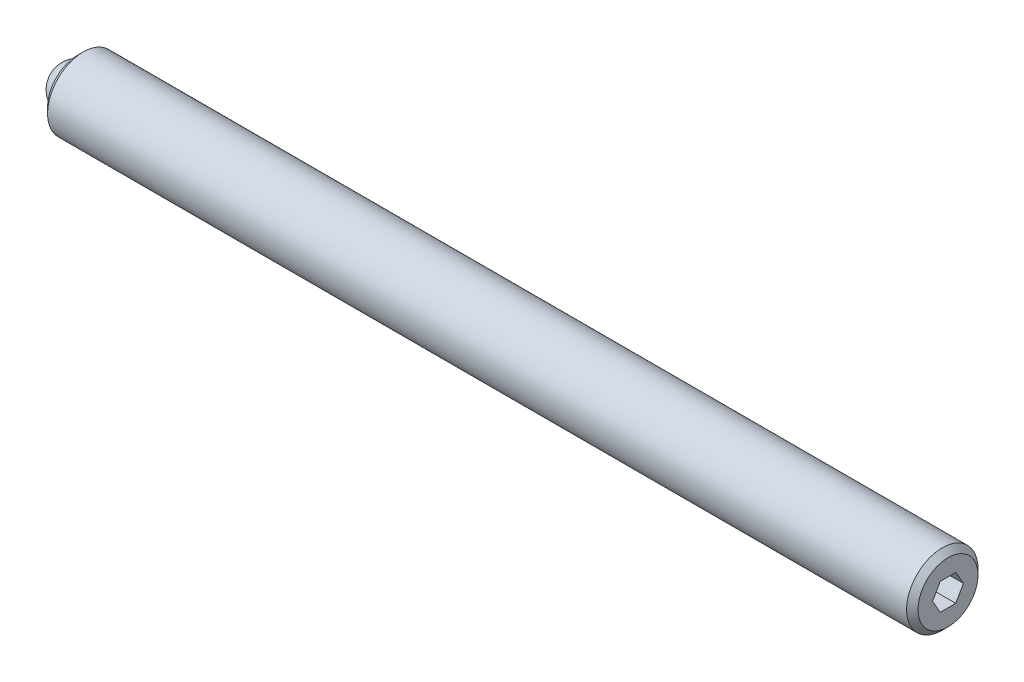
ISO-10303-21;
HEADER;
FILE_DESCRIPTION(('STEP AP214'),'2;1');
FILE_NAME('part.step','',(''),(''),'','','');
FILE_SCHEMA(('AUTOMOTIVE_DESIGN { 1 0 10303 214 1 1 1 1 }'));
ENDSEC;
DATA;
#1=APPLICATION_CONTEXT('core data for automotive mechanical design processes');
#2=APPLICATION_PROTOCOL_DEFINITION('international standard','automotive_design',2000,#1);
#3=PRODUCT_CONTEXT('',#1,'mechanical');
#4=PRODUCT('Part','Part','',(#3));
#5=PRODUCT_RELATED_PRODUCT_CATEGORY('part','',(#4));
#6=PRODUCT_DEFINITION_FORMATION('','',#4);
#7=PRODUCT_DEFINITION_CONTEXT('part definition',#1,'design');
#8=PRODUCT_DEFINITION('design','',#6,#7);
#9=PRODUCT_DEFINITION_SHAPE('','',#8);
#10=(LENGTH_UNIT() NAMED_UNIT(*) SI_UNIT(.MILLI.,.METRE.));
#11=(NAMED_UNIT(*) PLANE_ANGLE_UNIT() SI_UNIT($,.RADIAN.));
#12=(NAMED_UNIT(*) SI_UNIT($,.STERADIAN.) SOLID_ANGLE_UNIT());
#13=UNCERTAINTY_MEASURE_WITH_UNIT(LENGTH_MEASURE(1.E-05),#10,'distance_accuracy_value','');
#14=(GEOMETRIC_REPRESENTATION_CONTEXT(3) GLOBAL_UNCERTAINTY_ASSIGNED_CONTEXT((#13)) GLOBAL_UNIT_ASSIGNED_CONTEXT((#10,
#11,#12)) REPRESENTATION_CONTEXT('',''));
#15=CARTESIAN_POINT('',(0.,0.,0.));
#16=DIRECTION('',(0.,0.,1.));
#17=DIRECTION('',(1.,0.,0.));
#18=AXIS2_PLACEMENT_3D('',#15,#16,#17);
#19=CARTESIAN_POINT('',(0.,0.,0.));
#20=DIRECTION('',(0.,-1.,0.));
#21=DIRECTION('',(0.,0.,1.));
#22=AXIS2_PLACEMENT_3D('',#19,#20,#21);
#23=SPHERICAL_SURFACE('',#22,1.984375);
#24=CARTESIAN_POINT('',(0.,-1.984375,0.));
#25=VERTEX_POINT('',#24);
#26=VERTEX_LOOP('',#25);
#27=FACE_BOUND('',#26,.T.);
#28=ADVANCED_FACE('F43',(#27),#23,.T.);
#29=CLOSED_SHELL('',(#28));
#30=MANIFOLD_SOLID_BREP('B2',#29);
#31=CARTESIAN_POINT('',(77.390625,0.,0.));
#32=DIRECTION('',(-1.,0.,0.));
#33=DIRECTION('',(0.,0.,1.));
#34=AXIS2_PLACEMENT_3D('',#31,#32,#33);
#35=CYLINDRICAL_SURFACE('',#34,3.175);
#36=CARTESIAN_POINT('',(76.882625,0.,0.));
#37=DIRECTION('',(1.,0.,0.));
#38=DIRECTION('',(0.,0.,-1.));
#39=AXIS2_PLACEMENT_3D('',#36,#37,#38);
#40=CIRCLE('',#39,3.175);
#41=CARTESIAN_POINT('',(76.882625,0.,-3.175));
#42=VERTEX_POINT('',#41);
#43=EDGE_CURVE('E41',#42,#42,#40,.F.);
#44=ORIENTED_EDGE('',*,*,#43,.T.);
#45=EDGE_LOOP('',(#44));
#46=FACE_BOUND('',#45,.T.);
#47=CARTESIAN_POINT('',(0.507999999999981,0.,0.));
#48=DIRECTION('',(1.,0.,0.));
#49=DIRECTION('',(0.,0.,-1.));
#50=AXIS2_PLACEMENT_3D('',#47,#48,#49);
#51=CIRCLE('',#50,3.175);
#52=CARTESIAN_POINT('',(0.507999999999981,0.,-3.175));
#53=VERTEX_POINT('',#52);
#54=EDGE_CURVE('E159',#53,#53,#51,.T.);
#55=ORIENTED_EDGE('',*,*,#54,.T.);
#56=EDGE_LOOP('',(#55));
#57=FACE_BOUND('',#56,.T.);
#58=ADVANCED_FACE('F56',(#46,#57),#35,.T.);
#59=CARTESIAN_POINT('',(77.390625,0.,0.));
#60=DIRECTION('',(1.,0.,0.));
#61=DIRECTION('',(0.,0.,-1.));
#62=AXIS2_PLACEMENT_3D('',#59,#60,#61);
#63=PLANE('',#62);
#64=DIRECTION('',(0.,0.866025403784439,-0.5));
#65=VECTOR('',#64,1.);
#66=CARTESIAN_POINT('',(77.390625,-1.190625,-0.687407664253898));
#67=LINE('',#66,#65);
#68=CARTESIAN_POINT('',(77.390625,-1.190625,-0.687407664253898));
#69=VERTEX_POINT('',#68);
#70=CARTESIAN_POINT('',(77.390625,0.,-1.3748153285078));
#71=VERTEX_POINT('',#70);
#72=EDGE_CURVE('E71',#69,#71,#67,.T.);
#73=ORIENTED_EDGE('',*,*,#72,.F.);
#74=DIRECTION('',(0.,0.,-1.));
#75=VECTOR('',#74,1.);
#76=CARTESIAN_POINT('',(77.390625,-1.190625,0.687407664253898));
#77=LINE('',#76,#75);
#78=CARTESIAN_POINT('',(77.390625,-1.190625,0.687407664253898));
#79=VERTEX_POINT('',#78);
#80=EDGE_CURVE('E155',#79,#69,#77,.T.);
#81=ORIENTED_EDGE('',*,*,#80,.F.);
#82=DIRECTION('',(0.,-0.866025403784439,-0.5));
#83=VECTOR('',#82,1.);
#84=CARTESIAN_POINT('',(77.390625,0.,1.3748153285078));
#85=LINE('',#84,#83);
#86=CARTESIAN_POINT('',(77.390625,0.,1.3748153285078));
#87=VERTEX_POINT('',#86);
#88=EDGE_CURVE('E153',#87,#79,#85,.T.);
#89=ORIENTED_EDGE('',*,*,#88,.F.);
#90=DIRECTION('',(0.,-0.866025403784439,0.5));
#91=VECTOR('',#90,1.);
#92=CARTESIAN_POINT('',(77.390625,1.190625,0.687407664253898));
#93=LINE('',#92,#91);
#94=CARTESIAN_POINT('',(77.390625,1.190625,0.687407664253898));
#95=VERTEX_POINT('',#94);
#96=EDGE_CURVE('E119',#95,#87,#93,.T.);
#97=ORIENTED_EDGE('',*,*,#96,.F.);
#98=DIRECTION('',(0.,0.,1.));
#99=VECTOR('',#98,1.);
#100=CARTESIAN_POINT('',(77.390625,1.190625,-0.687407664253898));
#101=LINE('',#100,#99);
#102=CARTESIAN_POINT('',(77.390625,1.190625,-0.687407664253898));
#103=VERTEX_POINT('',#102);
#104=EDGE_CURVE('E149',#103,#95,#101,.T.);
#105=ORIENTED_EDGE('',*,*,#104,.F.);
#106=DIRECTION('',(0.,0.866025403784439,0.5));
#107=VECTOR('',#106,1.);
#108=CARTESIAN_POINT('',(77.390625,0.,-1.3748153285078));
#109=LINE('',#108,#107);
#110=EDGE_CURVE('E145',#71,#103,#109,.T.);
#111=ORIENTED_EDGE('',*,*,#110,.F.);
#112=EDGE_LOOP('',(#73,#81,#89,#97,#105,#111));
#113=FACE_BOUND('',#112,.T.);
#114=CARTESIAN_POINT('',(77.390625,0.,0.));
#115=DIRECTION('',(1.,0.,0.));
#116=DIRECTION('',(0.,0.,-1.));
#117=AXIS2_PLACEMENT_3D('',#114,#115,#116);
#118=CIRCLE('',#117,2.66700000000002);
#119=CARTESIAN_POINT('',(77.390625,0.,-2.66700000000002));
#120=VERTEX_POINT('',#119);
#121=EDGE_CURVE('E64',#120,#120,#118,.T.);
#122=ORIENTED_EDGE('',*,*,#121,.T.);
#123=EDGE_LOOP('',(#122));
#124=FACE_BOUND('',#123,.T.);
#125=ADVANCED_FACE('F172',(#113,#124),#63,.T.);
#126=CARTESIAN_POINT('',(0.,0.,0.));
#127=DIRECTION('',(1.,0.,0.));
#128=DIRECTION('',(0.,0.,-1.));
#129=AXIS2_PLACEMENT_3D('',#126,#127,#128);
#130=PLANE('',#129);
#131=CARTESIAN_POINT('',(0.,0.,0.));
#132=DIRECTION('',(-1.,0.,0.));
#133=DIRECTION('',(0.,0.,1.));
#134=AXIS2_PLACEMENT_3D('',#131,#132,#133);
#135=CIRCLE('',#134,1.9812);
#136=CARTESIAN_POINT('',(0.,0.,1.9812));
#137=VERTEX_POINT('',#136);
#138=EDGE_CURVE('E227',#137,#137,#135,.T.);
#139=ORIENTED_EDGE('',*,*,#138,.F.);
#140=EDGE_LOOP('',(#139));
#141=FACE_BOUND('',#140,.T.);
#142=CARTESIAN_POINT('',(0.,0.,0.));
#143=DIRECTION('',(1.,0.,0.));
#144=DIRECTION('',(0.,0.,-1.));
#145=AXIS2_PLACEMENT_3D('',#142,#143,#144);
#146=CIRCLE('',#145,2.66700000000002);
#147=CARTESIAN_POINT('',(0.,0.,-2.66700000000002));
#148=VERTEX_POINT('',#147);
#149=EDGE_CURVE('E167',#148,#148,#146,.F.);
#150=ORIENTED_EDGE('',*,*,#149,.T.);
#151=EDGE_LOOP('',(#150));
#152=FACE_BOUND('',#151,.T.);
#153=ADVANCED_FACE('F184',(#141,#152),#130,.F.);
#154=CARTESIAN_POINT('',(0.507999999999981,0.,0.));
#155=DIRECTION('',(1.,0.,0.));
#156=DIRECTION('',(0.,0.,-1.));
#157=AXIS2_PLACEMENT_3D('',#154,#155,#156);
#158=CONICAL_SURFACE('',#157,3.175,0.78539816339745);
#159=ORIENTED_EDGE('',*,*,#149,.F.);
#160=EDGE_LOOP('',(#159));
#161=FACE_BOUND('',#160,.T.);
#162=ORIENTED_EDGE('',*,*,#54,.F.);
#163=EDGE_LOOP('',(#162));
#164=FACE_BOUND('',#163,.T.);
#165=ADVANCED_FACE('F176',(#161,#164),#158,.T.);
#166=CARTESIAN_POINT('',(77.390625,0.,0.));
#167=DIRECTION('',(-1.,0.,0.));
#168=DIRECTION('',(0.,0.,1.));
#169=AXIS2_PLACEMENT_3D('',#166,#167,#168);
#170=CONICAL_SURFACE('',#169,2.66700000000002,0.785398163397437);
#171=ORIENTED_EDGE('',*,*,#43,.F.);
#172=EDGE_LOOP('',(#171));
#173=FACE_BOUND('',#172,.T.);
#174=ORIENTED_EDGE('',*,*,#121,.F.);
#175=EDGE_LOOP('',(#174));
#176=FACE_BOUND('',#175,.T.);
#177=ADVANCED_FACE('F58',(#173,#176),#170,.T.);
#178=CARTESIAN_POINT('',(75.104625,-1.190625,-0.687407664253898));
#179=DIRECTION('',(0.,-0.5,-0.866025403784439));
#180=DIRECTION('',(0.,0.866025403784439,-0.5));
#181=AXIS2_PLACEMENT_3D('',#178,#179,#180);
#182=PLANE('',#181);
#183=ORIENTED_EDGE('',*,*,#72,.T.);
#184=DIRECTION('',(1.,0.,0.));
#185=VECTOR('',#184,1.);
#186=CARTESIAN_POINT('',(75.104625,0.,-1.3748153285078));
#187=LINE('',#186,#185);
#188=CARTESIAN_POINT('',(75.104625,0.,-1.3748153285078));
#189=VERTEX_POINT('',#188);
#190=EDGE_CURVE('E101',#189,#71,#187,.T.);
#191=ORIENTED_EDGE('',*,*,#190,.F.);
#192=DIRECTION('',(0.,0.866025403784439,-0.5));
#193=VECTOR('',#192,1.);
#194=CARTESIAN_POINT('',(75.104625,-1.190625,-0.687407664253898));
#195=LINE('',#194,#193);
#196=CARTESIAN_POINT('',(75.104625,-1.190625,-0.687407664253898));
#197=VERTEX_POINT('',#196);
#198=EDGE_CURVE('E157',#197,#189,#195,.T.);
#199=ORIENTED_EDGE('',*,*,#198,.F.);
#200=DIRECTION('',(1.,0.,0.));
#201=VECTOR('',#200,1.);
#202=CARTESIAN_POINT('',(75.104625,-1.190625,-0.687407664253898));
#203=LINE('',#202,#201);
#204=EDGE_CURVE('E79',#197,#69,#203,.T.);
#205=ORIENTED_EDGE('',*,*,#204,.T.);
#206=EDGE_LOOP('',(#183,#191,#199,#205));
#207=FACE_BOUND('',#206,.T.);
#208=ADVANCED_FACE('F175',(#207),#182,.F.);
#209=CARTESIAN_POINT('',(75.104625,-1.190625,0.687407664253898));
#210=DIRECTION('',(0.,-1.,0.));
#211=DIRECTION('',(0.,0.,-1.));
#212=AXIS2_PLACEMENT_3D('',#209,#210,#211);
#213=PLANE('',#212);
#214=ORIENTED_EDGE('',*,*,#80,.T.);
#215=ORIENTED_EDGE('',*,*,#204,.F.);
#216=DIRECTION('',(0.,0.,-1.));
#217=VECTOR('',#216,1.);
#218=CARTESIAN_POINT('',(75.104625,-1.190625,0.687407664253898));
#219=LINE('',#218,#217);
#220=CARTESIAN_POINT('',(75.104625,-1.190625,0.687407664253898));
#221=VERTEX_POINT('',#220);
#222=EDGE_CURVE('E131',#221,#197,#219,.T.);
#223=ORIENTED_EDGE('',*,*,#222,.F.);
#224=DIRECTION('',(1.,0.,0.));
#225=VECTOR('',#224,1.);
#226=CARTESIAN_POINT('',(75.104625,-1.190625,0.687407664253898));
#227=LINE('',#226,#225);
#228=EDGE_CURVE('E123',#221,#79,#227,.T.);
#229=ORIENTED_EDGE('',*,*,#228,.T.);
#230=EDGE_LOOP('',(#214,#215,#223,#229));
#231=FACE_BOUND('',#230,.T.);
#232=ADVANCED_FACE('F182',(#231),#213,.F.);
#233=CARTESIAN_POINT('',(75.104625,0.,1.3748153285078));
#234=DIRECTION('',(0.,-0.5,0.866025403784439));
#235=DIRECTION('',(0.,-0.866025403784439,-0.5));
#236=AXIS2_PLACEMENT_3D('',#233,#234,#235);
#237=PLANE('',#236);
#238=ORIENTED_EDGE('',*,*,#88,.T.);
#239=ORIENTED_EDGE('',*,*,#228,.F.);
#240=DIRECTION('',(0.,-0.866025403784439,-0.5));
#241=VECTOR('',#240,1.);
#242=CARTESIAN_POINT('',(75.104625,0.,1.3748153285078));
#243=LINE('',#242,#241);
#244=CARTESIAN_POINT('',(75.104625,0.,1.3748153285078));
#245=VERTEX_POINT('',#244);
#246=EDGE_CURVE('E127',#245,#221,#243,.T.);
#247=ORIENTED_EDGE('',*,*,#246,.F.);
#248=DIRECTION('',(1.,0.,0.));
#249=VECTOR('',#248,1.);
#250=CARTESIAN_POINT('',(75.104625,0.,1.3748153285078));
#251=LINE('',#250,#249);
#252=EDGE_CURVE('E112',#245,#87,#251,.T.);
#253=ORIENTED_EDGE('',*,*,#252,.T.);
#254=EDGE_LOOP('',(#238,#239,#247,#253));
#255=FACE_BOUND('',#254,.T.);
#256=ADVANCED_FACE('F128',(#255),#237,.F.);
#257=CARTESIAN_POINT('',(75.104625,1.190625,0.687407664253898));
#258=DIRECTION('',(0.,0.5,0.866025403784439));
#259=DIRECTION('',(0.,-0.866025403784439,0.5));
#260=AXIS2_PLACEMENT_3D('',#257,#258,#259);
#261=PLANE('',#260);
#262=ORIENTED_EDGE('',*,*,#96,.T.);
#263=ORIENTED_EDGE('',*,*,#252,.F.);
#264=DIRECTION('',(0.,-0.866025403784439,0.5));
#265=VECTOR('',#264,1.);
#266=CARTESIAN_POINT('',(75.104625,1.190625,0.687407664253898));
#267=LINE('',#266,#265);
#268=CARTESIAN_POINT('',(75.104625,1.190625,0.687407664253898));
#269=VERTEX_POINT('',#268);
#270=EDGE_CURVE('E116',#269,#245,#267,.T.);
#271=ORIENTED_EDGE('',*,*,#270,.F.);
#272=DIRECTION('',(1.,0.,0.));
#273=VECTOR('',#272,1.);
#274=CARTESIAN_POINT('',(75.104625,1.190625,0.687407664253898));
#275=LINE('',#274,#273);
#276=EDGE_CURVE('E124',#269,#95,#275,.T.);
#277=ORIENTED_EDGE('',*,*,#276,.T.);
#278=EDGE_LOOP('',(#262,#263,#271,#277));
#279=FACE_BOUND('',#278,.T.);
#280=ADVANCED_FACE('F114',(#279),#261,.F.);
#281=CARTESIAN_POINT('',(75.104625,1.190625,-0.687407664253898));
#282=DIRECTION('',(0.,1.,0.));
#283=DIRECTION('',(0.,0.,1.));
#284=AXIS2_PLACEMENT_3D('',#281,#282,#283);
#285=PLANE('',#284);
#286=ORIENTED_EDGE('',*,*,#104,.T.);
#287=ORIENTED_EDGE('',*,*,#276,.F.);
#288=DIRECTION('',(0.,0.,1.));
#289=VECTOR('',#288,1.);
#290=CARTESIAN_POINT('',(75.104625,1.190625,-0.687407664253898));
#291=LINE('',#290,#289);
#292=CARTESIAN_POINT('',(75.104625,1.190625,-0.687407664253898));
#293=VERTEX_POINT('',#292);
#294=EDGE_CURVE('E137',#293,#269,#291,.T.);
#295=ORIENTED_EDGE('',*,*,#294,.F.);
#296=DIRECTION('',(1.,0.,0.));
#297=VECTOR('',#296,1.);
#298=CARTESIAN_POINT('',(75.104625,1.190625,-0.687407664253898));
#299=LINE('',#298,#297);
#300=EDGE_CURVE('E162',#293,#103,#299,.T.);
#301=ORIENTED_EDGE('',*,*,#300,.T.);
#302=EDGE_LOOP('',(#286,#287,#295,#301));
#303=FACE_BOUND('',#302,.T.);
#304=ADVANCED_FACE('F203',(#303),#285,.F.);
#305=CARTESIAN_POINT('',(75.104625,0.,-1.3748153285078));
#306=DIRECTION('',(0.,0.5,-0.866025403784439));
#307=DIRECTION('',(0.,0.866025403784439,0.5));
#308=AXIS2_PLACEMENT_3D('',#305,#306,#307);
#309=PLANE('',#308);
#310=ORIENTED_EDGE('',*,*,#110,.T.);
#311=ORIENTED_EDGE('',*,*,#300,.F.);
#312=DIRECTION('',(0.,0.866025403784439,0.5));
#313=VECTOR('',#312,1.);
#314=CARTESIAN_POINT('',(75.104625,0.,-1.3748153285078));
#315=LINE('',#314,#313);
#316=EDGE_CURVE('E139',#189,#293,#315,.T.);
#317=ORIENTED_EDGE('',*,*,#316,.F.);
#318=ORIENTED_EDGE('',*,*,#190,.T.);
#319=EDGE_LOOP('',(#310,#311,#317,#318));
#320=FACE_BOUND('',#319,.T.);
#321=ADVANCED_FACE('F200',(#320),#309,.F.);
#322=CARTESIAN_POINT('',(75.104625,0.,0.));
#323=DIRECTION('',(1.,0.,0.));
#324=DIRECTION('',(0.,0.,-1.));
#325=AXIS2_PLACEMENT_3D('',#322,#323,#324);
#326=PLANE('',#325);
#327=ORIENTED_EDGE('',*,*,#198,.T.);
#328=ORIENTED_EDGE('',*,*,#316,.T.);
#329=ORIENTED_EDGE('',*,*,#294,.T.);
#330=ORIENTED_EDGE('',*,*,#270,.T.);
#331=ORIENTED_EDGE('',*,*,#246,.T.);
#332=ORIENTED_EDGE('',*,*,#222,.T.);
#333=EDGE_LOOP('',(#327,#328,#329,#330,#331,#332));
#334=FACE_BOUND('',#333,.T.);
#335=ADVANCED_FACE('F134',(#334),#326,.T.);
#336=CARTESIAN_POINT('',(1.984375,0.,0.));
#337=DIRECTION('',(-1.,0.,0.));
#338=DIRECTION('',(0.,0.,1.));
#339=AXIS2_PLACEMENT_3D('',#336,#337,#338);
#340=CYLINDRICAL_SURFACE('',#339,1.9812);
#341=CARTESIAN_POINT('',(1.984375,0.,0.));
#342=DIRECTION('',(-1.,0.,0.));
#343=DIRECTION('',(0.,0.,1.));
#344=AXIS2_PLACEMENT_3D('',#341,#342,#343);
#345=CIRCLE('',#344,1.9812);
#346=CARTESIAN_POINT('',(1.984375,0.,1.9812));
#347=VERTEX_POINT('',#346);
#348=EDGE_CURVE('E146',#347,#347,#345,.T.);
#349=ORIENTED_EDGE('',*,*,#348,.F.);
#350=EDGE_LOOP('',(#349));
#351=FACE_BOUND('',#350,.T.);
#352=ORIENTED_EDGE('',*,*,#138,.T.);
#353=EDGE_LOOP('',(#352));
#354=FACE_BOUND('',#353,.T.);
#355=ADVANCED_FACE('F216',(#351,#354),#340,.F.);
#356=CARTESIAN_POINT('',(1.984375,0.,0.));
#357=DIRECTION('',(-1.,0.,0.));
#358=DIRECTION('',(0.,0.,1.));
#359=AXIS2_PLACEMENT_3D('',#356,#357,#358);
#360=PLANE('',#359);
#361=ORIENTED_EDGE('',*,*,#348,.T.);
#362=EDGE_LOOP('',(#361));
#363=FACE_BOUND('',#362,.T.);
#364=ADVANCED_FACE('F219',(#363),#360,.T.);
#365=CLOSED_SHELL('',(#58,#125,#153,#165,#177,#208,#232,#256,#280,#304,#321,#335,#355,#364));
#366=MANIFOLD_SOLID_BREP('B6',#365);
#367=ADVANCED_BREP_SHAPE_REPRESENTATION('',(#18,#30,#366),#14);
#368=SHAPE_DEFINITION_REPRESENTATION(#9,#367);
ENDSEC;
END-ISO-10303-21;
